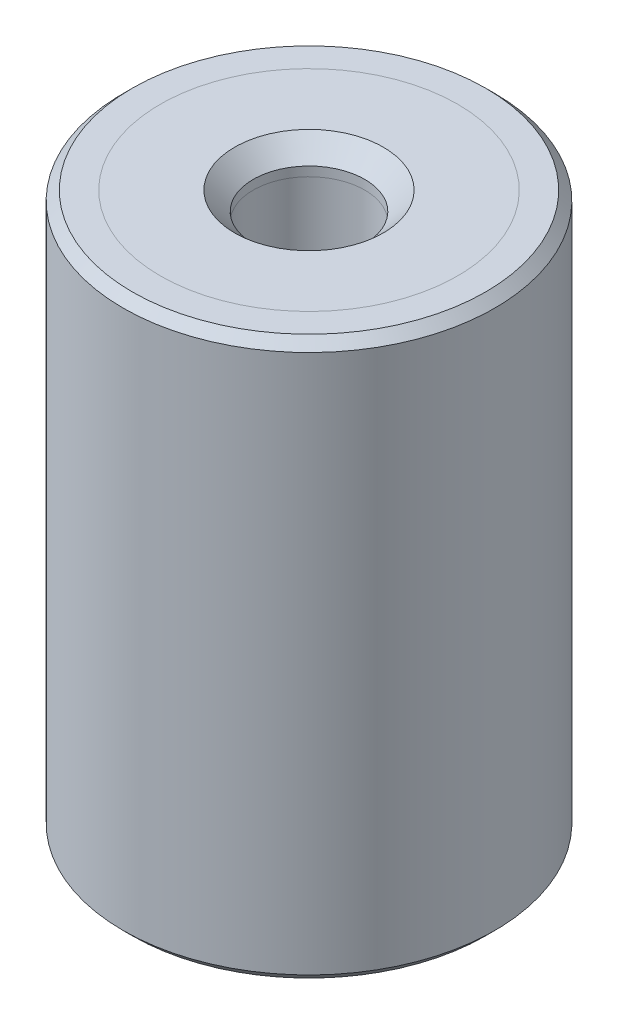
ISO-10303-21;
HEADER;
FILE_DESCRIPTION(('STEP AP214'),'2;1');
FILE_NAME('part.step','',(''),(''),'','','');
FILE_SCHEMA(('AUTOMOTIVE_DESIGN { 1 0 10303 214 1 1 1 1 }'));
ENDSEC;
DATA;
#1=APPLICATION_CONTEXT('core data for automotive mechanical design processes');
#2=APPLICATION_PROTOCOL_DEFINITION('international standard','automotive_design',2000,#1);
#3=PRODUCT_CONTEXT('',#1,'mechanical');
#4=PRODUCT('Part','Part','',(#3));
#5=PRODUCT_RELATED_PRODUCT_CATEGORY('part','',(#4));
#6=PRODUCT_DEFINITION_FORMATION('','',#4);
#7=PRODUCT_DEFINITION_CONTEXT('part definition',#1,'design');
#8=PRODUCT_DEFINITION('design','',#6,#7);
#9=PRODUCT_DEFINITION_SHAPE('','',#8);
#10=(LENGTH_UNIT() NAMED_UNIT(*) SI_UNIT(.MILLI.,.METRE.));
#11=(NAMED_UNIT(*) PLANE_ANGLE_UNIT() SI_UNIT($,.RADIAN.));
#12=(NAMED_UNIT(*) SI_UNIT($,.STERADIAN.) SOLID_ANGLE_UNIT());
#13=UNCERTAINTY_MEASURE_WITH_UNIT(LENGTH_MEASURE(1.E-05),#10,'distance_accuracy_value','');
#14=(GEOMETRIC_REPRESENTATION_CONTEXT(3) GLOBAL_UNCERTAINTY_ASSIGNED_CONTEXT((#13)) GLOBAL_UNIT_ASSIGNED_CONTEXT((#10,
#11,#12)) REPRESENTATION_CONTEXT('',''));
#15=CARTESIAN_POINT('',(0.,0.,0.));
#16=DIRECTION('',(0.,0.,1.));
#17=DIRECTION('',(1.,0.,0.));
#18=AXIS2_PLACEMENT_3D('',#15,#16,#17);
#19=CARTESIAN_POINT('',(0.,41.0340428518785,0.));
#20=DIRECTION('',(0.,1.,0.));
#21=DIRECTION('',(0.,0.,1.));
#22=AXIS2_PLACEMENT_3D('',#19,#20,#21);
#23=CYLINDRICAL_SURFACE('',#22,3.);
#24=CARTESIAN_POINT('',(0.,-27.5,0.));
#25=DIRECTION('',(0.,-1.,0.));
#26=DIRECTION('',(0.,0.,-1.));
#27=AXIS2_PLACEMENT_3D('',#24,#25,#26);
#28=CIRCLE('',#27,3.);
#29=CARTESIAN_POINT('',(0.,-27.5,-3.));
#30=VERTEX_POINT('',#29);
#31=EDGE_CURVE('P0_E10',#30,#30,#28,.T.);
#32=ORIENTED_EDGE('',*,*,#31,.T.);
#33=EDGE_LOOP('',(#32));
#34=FACE_BOUND('',#33,.T.);
#35=CARTESIAN_POINT('',(0.,-27.,0.));
#36=DIRECTION('',(0.,1.,0.));
#37=DIRECTION('',(0.,0.,1.));
#38=AXIS2_PLACEMENT_3D('',#35,#36,#37);
#39=CIRCLE('',#38,3.);
#40=CARTESIAN_POINT('',(0.,-27.,3.));
#41=VERTEX_POINT('',#40);
#42=EDGE_CURVE('P0_E25',#41,#41,#39,.T.);
#43=ORIENTED_EDGE('',*,*,#42,.T.);
#44=EDGE_LOOP('',(#43));
#45=FACE_BOUND('',#44,.T.);
#46=ADVANCED_FACE('P0_F14',(#34,#45),#23,.F.);
#47=CARTESIAN_POINT('',(0.,-27.,3.));
#48=DIRECTION('',(0.,1.,0.));
#49=DIRECTION('',(0.,0.,1.));
#50=AXIS2_PLACEMENT_3D('',#47,#48,#49);
#51=PLANE('',#50);
#52=CARTESIAN_POINT('',(0.,-27.,0.));
#53=DIRECTION('',(0.,1.,0.));
#54=DIRECTION('',(0.,0.,1.));
#55=AXIS2_PLACEMENT_3D('',#52,#53,#54);
#56=CIRCLE('',#55,8.);
#57=CARTESIAN_POINT('',(0.,-27.,8.));
#58=VERTEX_POINT('',#57);
#59=EDGE_CURVE('P0_E29',#58,#58,#56,.T.);
#60=ORIENTED_EDGE('',*,*,#59,.T.);
#61=EDGE_LOOP('',(#60));
#62=FACE_BOUND('',#61,.T.);
#63=ORIENTED_EDGE('',*,*,#42,.F.);
#64=EDGE_LOOP('',(#63));
#65=FACE_BOUND('',#64,.T.);
#66=ADVANCED_FACE('P0_F50',(#62,#65),#51,.T.);
#67=CARTESIAN_POINT('',(0.,41.0340428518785,0.));
#68=DIRECTION('',(0.,1.,0.));
#69=DIRECTION('',(0.,0.,1.));
#70=AXIS2_PLACEMENT_3D('',#67,#68,#69);
#71=CYLINDRICAL_SURFACE('',#70,8.);
#72=CARTESIAN_POINT('',(0.,-28.5,0.));
#73=DIRECTION('',(0.,1.,0.));
#74=DIRECTION('',(0.,0.,1.));
#75=AXIS2_PLACEMENT_3D('',#72,#73,#74);
#76=CIRCLE('',#75,8.);
#77=CARTESIAN_POINT('',(0.,-28.5,8.));
#78=VERTEX_POINT('',#77);
#79=EDGE_CURVE('P0_E34',#78,#78,#76,.T.);
#80=ORIENTED_EDGE('',*,*,#79,.T.);
#81=EDGE_LOOP('',(#80));
#82=FACE_BOUND('',#81,.T.);
#83=ORIENTED_EDGE('',*,*,#59,.F.);
#84=EDGE_LOOP('',(#83));
#85=FACE_BOUND('',#84,.T.);
#86=ADVANCED_FACE('P0_F38',(#82,#85),#71,.T.);
#87=CARTESIAN_POINT('',(0.,-28.5,8.));
#88=DIRECTION('',(0.,-1.,0.));
#89=DIRECTION('',(0.,0.,-1.));
#90=AXIS2_PLACEMENT_3D('',#87,#88,#89);
#91=PLANE('',#90);
#92=CARTESIAN_POINT('',(0.,-28.5,0.));
#93=DIRECTION('',(0.,-1.,0.));
#94=DIRECTION('',(0.,0.,-1.));
#95=AXIS2_PLACEMENT_3D('',#92,#93,#94);
#96=CIRCLE('',#95,4.);
#97=CARTESIAN_POINT('',(0.,-28.5,-4.));
#98=VERTEX_POINT('',#97);
#99=EDGE_CURVE('P0_E21',#98,#98,#96,.F.);
#100=ORIENTED_EDGE('',*,*,#99,.T.);
#101=EDGE_LOOP('',(#100));
#102=FACE_BOUND('',#101,.T.);
#103=ORIENTED_EDGE('',*,*,#79,.F.);
#104=EDGE_LOOP('',(#103));
#105=FACE_BOUND('',#104,.T.);
#106=ADVANCED_FACE('P0_F41',(#102,#105),#91,.T.);
#107=CARTESIAN_POINT('',(0.,-28.5,0.));
#108=DIRECTION('',(0.,-1.,0.));
#109=DIRECTION('',(0.,0.,-1.));
#110=AXIS2_PLACEMENT_3D('',#107,#108,#109);
#111=CONICAL_SURFACE('',#110,4.,0.785398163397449);
#112=ORIENTED_EDGE('',*,*,#31,.F.);
#113=EDGE_LOOP('',(#112));
#114=FACE_BOUND('',#113,.T.);
#115=ORIENTED_EDGE('',*,*,#99,.F.);
#116=EDGE_LOOP('',(#115));
#117=FACE_BOUND('',#116,.T.);
#118=ADVANCED_FACE('P0_F16',(#114,#117),#111,.F.);
#119=CLOSED_SHELL('',(#46,#66,#86,#106,#118));
#120=MANIFOLD_SOLID_BREP('P0_B1',#119);
#121=CARTESIAN_POINT('',(0.,69.5340428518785,0.));
#122=DIRECTION('',(0.,1.,0.));
#123=DIRECTION('',(0.,0.,1.));
#124=AXIS2_PLACEMENT_3D('',#121,#122,#123);
#125=CYLINDRICAL_SURFACE('',#124,3.);
#126=CARTESIAN_POINT('',(0.,0.5,0.));
#127=DIRECTION('',(0.,1.,0.));
#128=DIRECTION('',(0.,0.,1.));
#129=AXIS2_PLACEMENT_3D('',#126,#127,#128);
#130=CIRCLE('',#129,3.);
#131=CARTESIAN_POINT('',(0.,0.5,3.));
#132=VERTEX_POINT('',#131);
#133=EDGE_CURVE('P1_E21',#132,#132,#130,.T.);
#134=ORIENTED_EDGE('',*,*,#133,.T.);
#135=EDGE_LOOP('',(#134));
#136=FACE_BOUND('',#135,.T.);
#137=CARTESIAN_POINT('',(0.,0.,0.));
#138=DIRECTION('',(0.,1.,0.));
#139=DIRECTION('',(0.,0.,1.));
#140=AXIS2_PLACEMENT_3D('',#137,#138,#139);
#141=CIRCLE('',#140,3.);
#142=CARTESIAN_POINT('',(0.,0.,3.));
#143=VERTEX_POINT('',#142);
#144=EDGE_CURVE('P1_E34',#143,#143,#141,.T.);
#145=ORIENTED_EDGE('',*,*,#144,.F.);
#146=EDGE_LOOP('',(#145));
#147=FACE_BOUND('',#146,.T.);
#148=ADVANCED_FACE('P1_F14',(#136,#147),#125,.F.);
#149=CARTESIAN_POINT('',(0.,1.5,3.));
#150=DIRECTION('',(0.,1.,0.));
#151=DIRECTION('',(0.,0.,1.));
#152=AXIS2_PLACEMENT_3D('',#149,#150,#151);
#153=PLANE('',#152);
#154=CARTESIAN_POINT('',(0.,1.5,0.));
#155=DIRECTION('',(0.,1.,0.));
#156=DIRECTION('',(0.,0.,1.));
#157=AXIS2_PLACEMENT_3D('',#154,#155,#156);
#158=CIRCLE('',#157,4.);
#159=CARTESIAN_POINT('',(0.,1.5,4.));
#160=VERTEX_POINT('',#159);
#161=EDGE_CURVE('P1_E10',#160,#160,#158,.F.);
#162=ORIENTED_EDGE('',*,*,#161,.T.);
#163=EDGE_LOOP('',(#162));
#164=FACE_BOUND('',#163,.T.);
#165=CARTESIAN_POINT('',(0.,1.5,0.));
#166=DIRECTION('',(0.,1.,0.));
#167=DIRECTION('',(0.,0.,1.));
#168=AXIS2_PLACEMENT_3D('',#165,#166,#167);
#169=CIRCLE('',#168,8.);
#170=CARTESIAN_POINT('',(0.,1.5,8.));
#171=VERTEX_POINT('',#170);
#172=EDGE_CURVE('P1_E25',#171,#171,#169,.T.);
#173=ORIENTED_EDGE('',*,*,#172,.T.);
#174=EDGE_LOOP('',(#173));
#175=FACE_BOUND('',#174,.T.);
#176=ADVANCED_FACE('P1_F42',(#164,#175),#153,.T.);
#177=CARTESIAN_POINT('',(0.,69.5340428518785,0.));
#178=DIRECTION('',(0.,1.,0.));
#179=DIRECTION('',(0.,0.,1.));
#180=AXIS2_PLACEMENT_3D('',#177,#178,#179);
#181=CYLINDRICAL_SURFACE('',#180,8.);
#182=CARTESIAN_POINT('',(0.,0.,0.));
#183=DIRECTION('',(0.,1.,0.));
#184=DIRECTION('',(0.,0.,1.));
#185=AXIS2_PLACEMENT_3D('',#182,#183,#184);
#186=CIRCLE('',#185,8.);
#187=CARTESIAN_POINT('',(0.,0.,8.));
#188=VERTEX_POINT('',#187);
#189=EDGE_CURVE('P1_E29',#188,#188,#186,.T.);
#190=ORIENTED_EDGE('',*,*,#189,.T.);
#191=EDGE_LOOP('',(#190));
#192=FACE_BOUND('',#191,.T.);
#193=ORIENTED_EDGE('',*,*,#172,.F.);
#194=EDGE_LOOP('',(#193));
#195=FACE_BOUND('',#194,.T.);
#196=ADVANCED_FACE('P1_F47',(#192,#195),#181,.T.);
#197=CARTESIAN_POINT('',(0.,0.,8.));
#198=DIRECTION('',(0.,-1.,0.));
#199=DIRECTION('',(0.,0.,-1.));
#200=AXIS2_PLACEMENT_3D('',#197,#198,#199);
#201=PLANE('',#200);
#202=ORIENTED_EDGE('',*,*,#144,.T.);
#203=EDGE_LOOP('',(#202));
#204=FACE_BOUND('',#203,.T.);
#205=ORIENTED_EDGE('',*,*,#189,.F.);
#206=EDGE_LOOP('',(#205));
#207=FACE_BOUND('',#206,.T.);
#208=ADVANCED_FACE('P1_F38',(#204,#207),#201,.T.);
#209=CARTESIAN_POINT('',(0.,0.5,0.));
#210=DIRECTION('',(0.,1.,0.));
#211=DIRECTION('',(0.,0.,1.));
#212=AXIS2_PLACEMENT_3D('',#209,#210,#211);
#213=CONICAL_SURFACE('',#212,3.,0.78539816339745);
#214=ORIENTED_EDGE('',*,*,#161,.F.);
#215=EDGE_LOOP('',(#214));
#216=FACE_BOUND('',#215,.T.);
#217=ORIENTED_EDGE('',*,*,#133,.F.);
#218=EDGE_LOOP('',(#217));
#219=FACE_BOUND('',#218,.T.);
#220=ADVANCED_FACE('P1_F16',(#216,#219),#213,.F.);
#221=CLOSED_SHELL('',(#148,#176,#196,#208,#220));
#222=MANIFOLD_SOLID_BREP('P1_B1',#221);
#223=CARTESIAN_POINT('',(0.,0.,0.));
#224=DIRECTION('',(0.,1.,0.));
#225=DIRECTION('',(0.,0.,1.));
#226=AXIS2_PLACEMENT_3D('',#223,#224,#225);
#227=PLANE('',#226);
#228=CARTESIAN_POINT('',(0.,0.,0.));
#229=DIRECTION('',(0.,1.,0.));
#230=DIRECTION('',(0.,0.,1.));
#231=AXIS2_PLACEMENT_3D('',#228,#229,#230);
#232=CIRCLE('',#231,3.);
#233=CARTESIAN_POINT('',(0.,0.,3.));
#234=VERTEX_POINT('',#233);
#235=EDGE_CURVE('P2_E46',#234,#234,#232,.T.);
#236=ORIENTED_EDGE('',*,*,#235,.F.);
#237=EDGE_LOOP('',(#236));
#238=FACE_BOUND('',#237,.T.);
#239=CARTESIAN_POINT('',(0.,0.,0.));
#240=DIRECTION('',(0.,1.,0.));
#241=DIRECTION('',(0.,0.,1.));
#242=AXIS2_PLACEMENT_3D('',#239,#240,#241);
#243=CIRCLE('',#242,8.);
#244=CARTESIAN_POINT('',(0.,0.,8.));
#245=VERTEX_POINT('',#244);
#246=EDGE_CURVE('P2_E33',#245,#245,#243,.T.);
#247=ORIENTED_EDGE('',*,*,#246,.T.);
#248=EDGE_LOOP('',(#247));
#249=FACE_BOUND('',#248,.T.);
#250=ADVANCED_FACE('P2_F13',(#238,#249),#227,.T.);
#251=CARTESIAN_POINT('',(0.,65.5134936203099,0.));
#252=DIRECTION('',(0.,1.,0.));
#253=DIRECTION('',(0.,0.,1.));
#254=AXIS2_PLACEMENT_3D('',#251,#252,#253);
#255=CYLINDRICAL_SURFACE('',#254,8.);
#256=CARTESIAN_POINT('',(0.,1.5,0.));
#257=DIRECTION('',(0.,1.,0.));
#258=DIRECTION('',(0.,0.,1.));
#259=AXIS2_PLACEMENT_3D('',#256,#257,#258);
#260=CIRCLE('',#259,8.);
#261=CARTESIAN_POINT('',(0.,1.5,8.));
#262=VERTEX_POINT('',#261);
#263=EDGE_CURVE('P2_E36',#262,#262,#260,.T.);
#264=ORIENTED_EDGE('',*,*,#263,.T.);
#265=EDGE_LOOP('',(#264));
#266=FACE_BOUND('',#265,.T.);
#267=ORIENTED_EDGE('',*,*,#246,.F.);
#268=EDGE_LOOP('',(#267));
#269=FACE_BOUND('',#268,.T.);
#270=ADVANCED_FACE('P2_F92',(#266,#269),#255,.F.);
#271=CARTESIAN_POINT('',(0.,1.5,8.));
#272=DIRECTION('',(0.,1.,0.));
#273=DIRECTION('',(0.,0.,1.));
#274=AXIS2_PLACEMENT_3D('',#271,#272,#273);
#275=PLANE('',#274);
#276=CARTESIAN_POINT('',(0.,1.5,0.));
#277=DIRECTION('',(0.,1.,0.));
#278=DIRECTION('',(0.,0.,1.));
#279=AXIS2_PLACEMENT_3D('',#276,#277,#278);
#280=CIRCLE('',#279,9.5);
#281=CARTESIAN_POINT('',(0.,1.5,9.5));
#282=VERTEX_POINT('',#281);
#283=EDGE_CURVE('P2_E9',#282,#282,#280,.T.);
#284=ORIENTED_EDGE('',*,*,#283,.T.);
#285=EDGE_LOOP('',(#284));
#286=FACE_BOUND('',#285,.T.);
#287=ORIENTED_EDGE('',*,*,#263,.F.);
#288=EDGE_LOOP('',(#287));
#289=FACE_BOUND('',#288,.T.);
#290=ADVANCED_FACE('P2_F88',(#286,#289),#275,.T.);
#291=CARTESIAN_POINT('',(0.,65.5134936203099,0.));
#292=DIRECTION('',(0.,1.,0.));
#293=DIRECTION('',(0.,0.,1.));
#294=AXIS2_PLACEMENT_3D('',#291,#292,#293);
#295=CYLINDRICAL_SURFACE('',#294,10.);
#296=CARTESIAN_POINT('',(0.,-28.,0.));
#297=DIRECTION('',(0.,-1.,0.));
#298=DIRECTION('',(0.,0.,-1.));
#299=AXIS2_PLACEMENT_3D('',#296,#297,#298);
#300=CIRCLE('',#299,10.);
#301=CARTESIAN_POINT('',(0.,-28.,-10.));
#302=VERTEX_POINT('',#301);
#303=EDGE_CURVE('P2_E24',#302,#302,#300,.F.);
#304=ORIENTED_EDGE('',*,*,#303,.T.);
#305=EDGE_LOOP('',(#304));
#306=FACE_BOUND('',#305,.T.);
#307=CARTESIAN_POINT('',(0.,1.,0.));
#308=DIRECTION('',(0.,1.,0.));
#309=DIRECTION('',(0.,0.,1.));
#310=AXIS2_PLACEMENT_3D('',#307,#308,#309);
#311=CIRCLE('',#310,10.);
#312=CARTESIAN_POINT('',(0.,1.,10.));
#313=VERTEX_POINT('',#312);
#314=EDGE_CURVE('P2_E28',#313,#313,#311,.F.);
#315=ORIENTED_EDGE('',*,*,#314,.T.);
#316=EDGE_LOOP('',(#315));
#317=FACE_BOUND('',#316,.T.);
#318=ADVANCED_FACE('P2_F82',(#306,#317),#295,.T.);
#319=CARTESIAN_POINT('',(0.,-28.5,10.));
#320=DIRECTION('',(0.,-1.,0.));
#321=DIRECTION('',(0.,0.,-1.));
#322=AXIS2_PLACEMENT_3D('',#319,#320,#321);
#323=PLANE('',#322);
#324=CARTESIAN_POINT('',(0.,-28.5,0.));
#325=DIRECTION('',(0.,-1.,0.));
#326=DIRECTION('',(0.,0.,-1.));
#327=AXIS2_PLACEMENT_3D('',#324,#325,#326);
#328=CIRCLE('',#327,9.49999999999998);
#329=CARTESIAN_POINT('',(0.,-28.5,-9.49999999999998));
#330=VERTEX_POINT('',#329);
#331=EDGE_CURVE('P2_E20',#330,#330,#328,.T.);
#332=ORIENTED_EDGE('',*,*,#331,.T.);
#333=EDGE_LOOP('',(#332));
#334=FACE_BOUND('',#333,.T.);
#335=CARTESIAN_POINT('',(0.,-28.5,0.));
#336=DIRECTION('',(0.,1.,0.));
#337=DIRECTION('',(0.,0.,1.));
#338=AXIS2_PLACEMENT_3D('',#335,#336,#337);
#339=CIRCLE('',#338,8.);
#340=CARTESIAN_POINT('',(0.,-28.5,8.));
#341=VERTEX_POINT('',#340);
#342=EDGE_CURVE('P2_E39',#341,#341,#339,.T.);
#343=ORIENTED_EDGE('',*,*,#342,.T.);
#344=EDGE_LOOP('',(#343));
#345=FACE_BOUND('',#344,.T.);
#346=ADVANCED_FACE('P2_F77',(#334,#345),#323,.T.);
#347=CARTESIAN_POINT('',(0.,65.5134936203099,0.));
#348=DIRECTION('',(0.,1.,0.));
#349=DIRECTION('',(0.,0.,1.));
#350=AXIS2_PLACEMENT_3D('',#347,#348,#349);
#351=CYLINDRICAL_SURFACE('',#350,8.);
#352=CARTESIAN_POINT('',(0.,-27.,0.));
#353=DIRECTION('',(0.,1.,0.));
#354=DIRECTION('',(0.,0.,1.));
#355=AXIS2_PLACEMENT_3D('',#352,#353,#354);
#356=CIRCLE('',#355,8.);
#357=CARTESIAN_POINT('',(0.,-27.,8.));
#358=VERTEX_POINT('',#357);
#359=EDGE_CURVE('P2_E42',#358,#358,#356,.T.);
#360=ORIENTED_EDGE('',*,*,#359,.T.);
#361=EDGE_LOOP('',(#360));
#362=FACE_BOUND('',#361,.T.);
#363=ORIENTED_EDGE('',*,*,#342,.F.);
#364=EDGE_LOOP('',(#363));
#365=FACE_BOUND('',#364,.T.);
#366=ADVANCED_FACE('P2_F71',(#362,#365),#351,.F.);
#367=CARTESIAN_POINT('',(0.,-27.,8.));
#368=DIRECTION('',(0.,-1.,0.));
#369=DIRECTION('',(0.,0.,-1.));
#370=AXIS2_PLACEMENT_3D('',#367,#368,#369);
#371=PLANE('',#370);
#372=CARTESIAN_POINT('',(0.,-27.,0.));
#373=DIRECTION('',(0.,-1.,0.));
#374=DIRECTION('',(0.,0.,-1.));
#375=AXIS2_PLACEMENT_3D('',#372,#373,#374);
#376=CIRCLE('',#375,3.);
#377=CARTESIAN_POINT('',(0.,-27.,-3.));
#378=VERTEX_POINT('',#377);
#379=EDGE_CURVE('P2_E52',#378,#378,#376,.T.);
#380=ORIENTED_EDGE('',*,*,#379,.F.);
#381=EDGE_LOOP('',(#380));
#382=FACE_BOUND('',#381,.T.);
#383=ORIENTED_EDGE('',*,*,#359,.F.);
#384=EDGE_LOOP('',(#383));
#385=FACE_BOUND('',#384,.T.);
#386=ADVANCED_FACE('P2_F67',(#382,#385),#371,.T.);
#387=CARTESIAN_POINT('',(0.,-28.,0.));
#388=DIRECTION('',(0.,1.,0.));
#389=DIRECTION('',(0.,0.,1.));
#390=AXIS2_PLACEMENT_3D('',#387,#388,#389);
#391=CONICAL_SURFACE('',#390,10.,0.785398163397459);
#392=ORIENTED_EDGE('',*,*,#331,.F.);
#393=EDGE_LOOP('',(#392));
#394=FACE_BOUND('',#393,.T.);
#395=ORIENTED_EDGE('',*,*,#303,.F.);
#396=EDGE_LOOP('',(#395));
#397=FACE_BOUND('',#396,.T.);
#398=ADVANCED_FACE('P2_F70',(#394,#397),#391,.T.);
#399=CARTESIAN_POINT('',(0.,1.5,0.));
#400=DIRECTION('',(0.,-1.,0.));
#401=DIRECTION('',(0.,0.,-1.));
#402=AXIS2_PLACEMENT_3D('',#399,#400,#401);
#403=CONICAL_SURFACE('',#402,9.5,0.785398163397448);
#404=ORIENTED_EDGE('',*,*,#314,.F.);
#405=EDGE_LOOP('',(#404));
#406=FACE_BOUND('',#405,.T.);
#407=ORIENTED_EDGE('',*,*,#283,.F.);
#408=EDGE_LOOP('',(#407));
#409=FACE_BOUND('',#408,.T.);
#410=ADVANCED_FACE('P2_F15',(#406,#409),#403,.T.);
#411=CARTESIAN_POINT('',(0.,-4.5,0.));
#412=DIRECTION('',(0.,1.,0.));
#413=DIRECTION('',(0.,0.,1.));
#414=AXIS2_PLACEMENT_3D('',#411,#412,#413);
#415=CYLINDRICAL_SURFACE('',#414,3.);
#416=CARTESIAN_POINT('',(0.,-4.5,0.));
#417=DIRECTION('',(0.,1.,0.));
#418=DIRECTION('',(0.,0.,1.));
#419=AXIS2_PLACEMENT_3D('',#416,#417,#418);
#420=CIRCLE('',#419,3.);
#421=CARTESIAN_POINT('',(0.,-4.5,3.));
#422=VERTEX_POINT('',#421);
#423=EDGE_CURVE('P2_E45',#422,#422,#420,.T.);
#424=ORIENTED_EDGE('',*,*,#423,.F.);
#425=EDGE_LOOP('',(#424));
#426=FACE_BOUND('',#425,.T.);
#427=ORIENTED_EDGE('',*,*,#235,.T.);
#428=EDGE_LOOP('',(#427));
#429=FACE_BOUND('',#428,.T.);
#430=ADVANCED_FACE('P2_F108',(#426,#429),#415,.F.);
#431=CARTESIAN_POINT('',(0.,-4.5,0.));
#432=DIRECTION('',(0.,1.,0.));
#433=DIRECTION('',(0.,0.,1.));
#434=AXIS2_PLACEMENT_3D('',#431,#432,#433);
#435=PLANE('',#434);
#436=ORIENTED_EDGE('',*,*,#423,.T.);
#437=EDGE_LOOP('',(#436));
#438=FACE_BOUND('',#437,.T.);
#439=ADVANCED_FACE('P2_F63',(#438),#435,.T.);
#440=CARTESIAN_POINT('',(0.,-22.5,0.));
#441=DIRECTION('',(0.,-1.,0.));
#442=DIRECTION('',(0.,0.,-1.));
#443=AXIS2_PLACEMENT_3D('',#440,#441,#442);
#444=CYLINDRICAL_SURFACE('',#443,3.);
#445=CARTESIAN_POINT('',(0.,-22.5,0.));
#446=DIRECTION('',(0.,-1.,0.));
#447=DIRECTION('',(0.,0.,-1.));
#448=AXIS2_PLACEMENT_3D('',#445,#446,#447);
#449=CIRCLE('',#448,3.);
#450=CARTESIAN_POINT('',(0.,-22.5,-3.));
#451=VERTEX_POINT('',#450);
#452=EDGE_CURVE('P2_E49',#451,#451,#449,.T.);
#453=ORIENTED_EDGE('',*,*,#452,.F.);
#454=EDGE_LOOP('',(#453));
#455=FACE_BOUND('',#454,.T.);
#456=ORIENTED_EDGE('',*,*,#379,.T.);
#457=EDGE_LOOP('',(#456));
#458=FACE_BOUND('',#457,.T.);
#459=ADVANCED_FACE('P2_F60',(#455,#458),#444,.F.);
#460=CARTESIAN_POINT('',(0.,-22.5,0.));
#461=DIRECTION('',(0.,-1.,0.));
#462=DIRECTION('',(0.,0.,-1.));
#463=AXIS2_PLACEMENT_3D('',#460,#461,#462);
#464=PLANE('',#463);
#465=ORIENTED_EDGE('',*,*,#452,.T.);
#466=EDGE_LOOP('',(#465));
#467=FACE_BOUND('',#466,.T.);
#468=ADVANCED_FACE('P2_F58',(#467),#464,.T.);
#469=CLOSED_SHELL('',(#250,#270,#290,#318,#346,#366,#386,#398,#410,#430,#439,#459,#468));
#470=MANIFOLD_SOLID_BREP('P2_B1',#469);
#471=ADVANCED_BREP_SHAPE_REPRESENTATION('',(#18,#120,#222,#470),#14);
#472=SHAPE_DEFINITION_REPRESENTATION(#9,#471);
ENDSEC;
END-ISO-10303-21;
